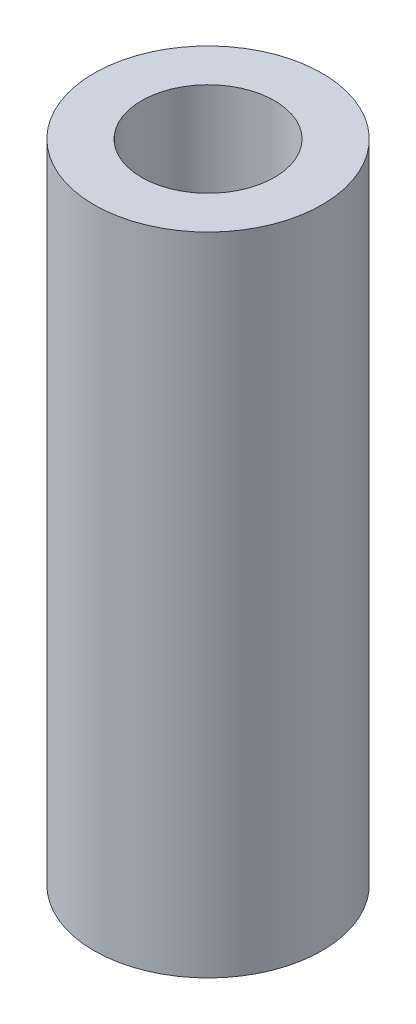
from build123d import *

# Parameters (mm, degrees)
SKETCH1_R      = 3
SKETCH1_R_2    = 1.75
EXTRUDE1_DEPTH = 17


with BuildPart() as part:
    # Sketch1 → Extrude1 (new body)
    with BuildSketch(Plane(origin=(0, 0, 0), x_dir=(1, 0, 0), z_dir=(0, 1, 0))):
        with Locations(Location((0, 0, 0), (0, 0, 270))):
            Circle(SKETCH1_R)
        with Locations(Location((0, 0, 0), (0, 0, 270))):
            Circle(SKETCH1_R_2, mode=Mode.SUBTRACT)
    extrude(amount=EXTRUDE1_DEPTH)


solid = part.part
